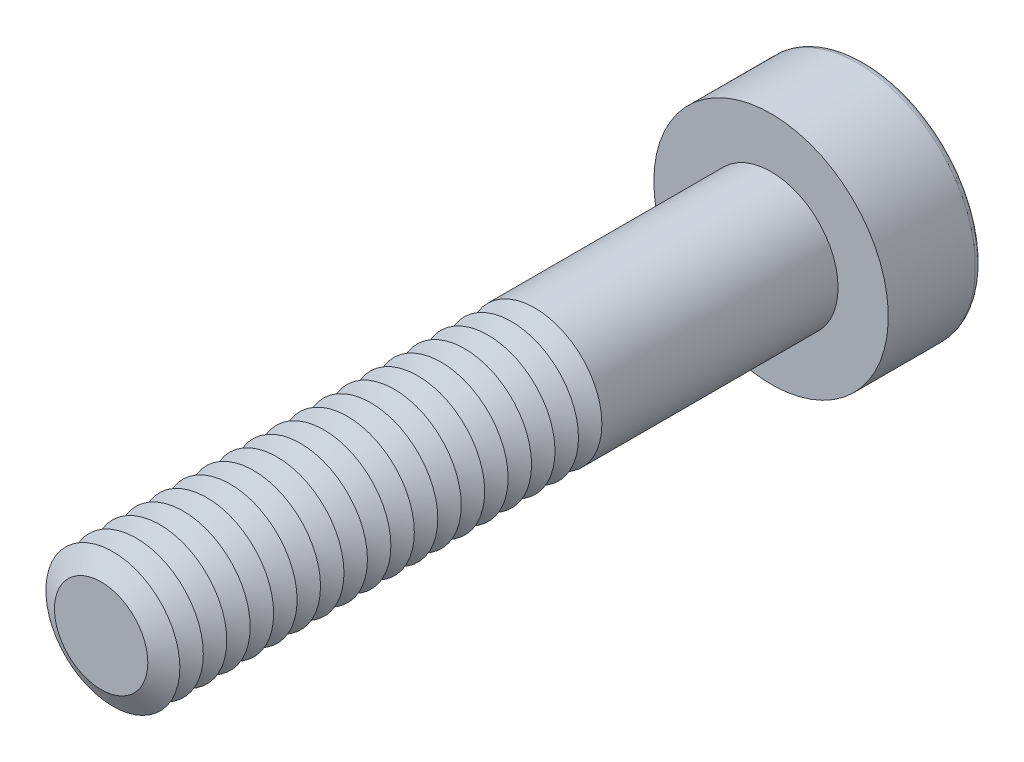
from build123d import *

# Parameters (mm, degrees)
SKETCH1_R           = 2
BOSS_EXTRUDE1_DEPTH = 20
SKETCH2_R           = 3.5
BOSS_EXTRUDE2_DEPTH = 2.8
CUT_EXTRUDE1_DEPTH  = 1.875
FILLET1_R           = 0.2
LPATTERN1_COUNT     = 19
LPATTERN1_PITCH     = 0.7


with BuildPart() as part:
    # Sketch1 → Boss-Extrude1 (new body)
    with BuildSketch(Plane.XY):
        Circle(SKETCH1_R)
    extrude(amount=BOSS_EXTRUDE1_DEPTH)

    # Sketch2 → Boss-Extrude2 (add)
    with BuildSketch(Plane(origin=(0, 0, 0), x_dir=(-1, 0, 0), z_dir=(0, 0, -1))):
        Circle(SKETCH2_R)
    extrude(amount=BOSS_EXTRUDE2_DEPTH)

    # Sketch3 → Cut-Extrude1 (cut)
    with BuildSketch(Plane(origin=(0, 0, -2.8), x_dir=(-1, 0, 0), z_dir=(0, 0, -1))):
        Polygon((-0.721687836, 1.25), (-1.443375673, 0), (-0.721687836, -1.25), (0.721687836, -1.25), (1.443375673, 0), (0.721687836, 1.25), align=None)
    extrude(amount=-CUT_EXTRUDE1_DEPTH, mode=Mode.SUBTRACT)

    # Fillet1
    fillet1_edges = [part.edges().sort_by_distance(p)[0] for p in [
        (3.5, 0, -2.8),
    ]]
    fillet(fillet1_edges, radius=FILLET1_R)

    # Cut-Extrude2 cone 1 section (on through the dimple's axis) → Cut-Extrude2 (revolve, cut)
    with BuildSketch(Plane(origin=(0, 0, -0.925), x_dir=(0, 1, 0), z_dir=(1, 0, 0))):
        Polygon((0, 0), (1.25, 0), (0, 0.721687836), align=None)
    revolve(axis=Axis((0, 0, -0.925), (0, 0, 1)), mode=Mode.SUBTRACT)

    # Cut-Extrude3 cone 1 section (on through the dimple's axis) → Cut-Extrude3 (revolve, cut)
    with BuildSketch(Plane(origin=(0, 0, -2.8), x_dir=(0, 1, 0), z_dir=(1, 0, 0))):
        Polygon((0, 0), (1.443375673, 0), (0, 0.386751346), align=None)
    revolve(axis=Axis((0, 0, -2.8), (0, 0, 1)), mode=Mode.SUBTRACT)

    # Sketch7 → Cut-Revolve1 (revolve, cut)
    with BuildSketch(Plane(origin=(0, 0, 0), x_dir=(0, 0, -1), z_dir=(1, 0, 0)), mode=Mode.PRIVATE) as cut_revolve1_sk:
        Polygon((-20, 1.393782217), (-19.65, 2), (-20.35, 2), align=None)
    cut_revolve1 = revolve(cut_revolve1_sk.sketch.rotate(Axis((0, 0, 20), (0, 0, -1)), 90), axis=Axis((0, 0, 20), (0, 0, -1)), mode=Mode.SUBTRACT)

    # LPattern1: Cut-Revolve1 ×19
    with Locations(*[(0, 0, -i * LPATTERN1_PITCH) for i in range(1, LPATTERN1_COUNT)]):
        add(cut_revolve1, mode=Mode.SUBTRACT)


solid = part.part
